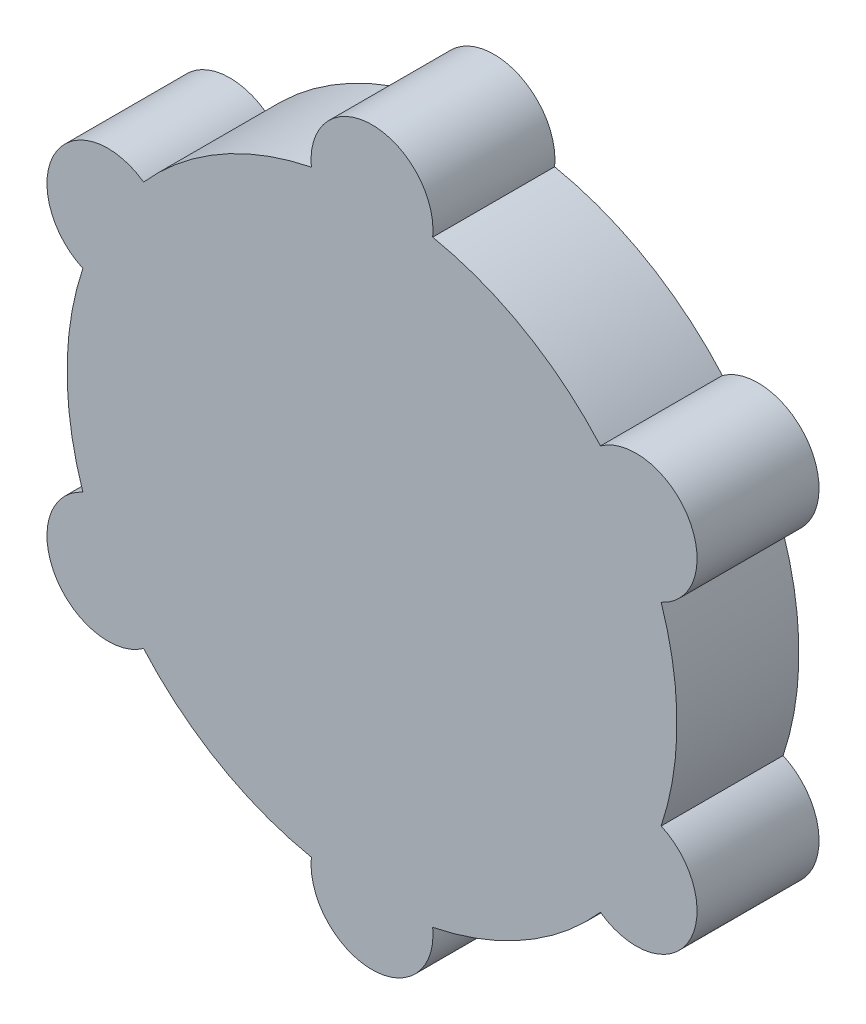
ISO-10303-21;
HEADER;
FILE_DESCRIPTION(('STEP AP214'),'2;1');
FILE_NAME('part.step','',(''),(''),'','','');
FILE_SCHEMA(('AUTOMOTIVE_DESIGN { 1 0 10303 214 1 1 1 1 }'));
ENDSEC;
DATA;
#1=APPLICATION_CONTEXT('core data for automotive mechanical design processes');
#2=APPLICATION_PROTOCOL_DEFINITION('international standard','automotive_design',2000,#1);
#3=PRODUCT_CONTEXT('',#1,'mechanical');
#4=PRODUCT('Part','Part','',(#3));
#5=PRODUCT_RELATED_PRODUCT_CATEGORY('part','',(#4));
#6=PRODUCT_DEFINITION_FORMATION('','',#4);
#7=PRODUCT_DEFINITION_CONTEXT('part definition',#1,'design');
#8=PRODUCT_DEFINITION('design','',#6,#7);
#9=PRODUCT_DEFINITION_SHAPE('','',#8);
#10=(LENGTH_UNIT() NAMED_UNIT(*) SI_UNIT(.MILLI.,.METRE.));
#11=(NAMED_UNIT(*) PLANE_ANGLE_UNIT() SI_UNIT($,.RADIAN.));
#12=(NAMED_UNIT(*) SI_UNIT($,.STERADIAN.) SOLID_ANGLE_UNIT());
#13=UNCERTAINTY_MEASURE_WITH_UNIT(LENGTH_MEASURE(1.E-05),#10,'distance_accuracy_value','');
#14=(GEOMETRIC_REPRESENTATION_CONTEXT(3) GLOBAL_UNCERTAINTY_ASSIGNED_CONTEXT((#13)) GLOBAL_UNIT_ASSIGNED_CONTEXT((#10,
#11,#12)) REPRESENTATION_CONTEXT('',''));
#15=CARTESIAN_POINT('',(0.,0.,0.));
#16=DIRECTION('',(0.,0.,1.));
#17=DIRECTION('',(1.,0.,0.));
#18=AXIS2_PLACEMENT_3D('',#15,#16,#17);
#19=CARTESIAN_POINT('',(43.301270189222,24.9999999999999,20.));
#20=DIRECTION('',(0.,0.,-1.));
#21=DIRECTION('',(-1.,0.,0.));
#22=AXIS2_PLACEMENT_3D('',#19,#20,#21);
#23=CYLINDRICAL_SURFACE('',#22,10.);
#24=CARTESIAN_POINT('',(43.301270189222,24.9999999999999,0.));
#25=DIRECTION('',(0.,0.,1.));
#26=DIRECTION('',(1.,0.,0.));
#27=AXIS2_PLACEMENT_3D('',#24,#25,#26);
#28=CIRCLE('',#27,10.);
#29=CARTESIAN_POINT('',(47.4101819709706,15.8831560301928,0.));
#30=VERTEX_POINT('',#29);
#31=CARTESIAN_POINT('',(37.4603075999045,33.1168439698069,0.));
#32=VERTEX_POINT('',#31);
#33=EDGE_CURVE('E124',#30,#32,#28,.T.);
#34=ORIENTED_EDGE('',*,*,#33,.T.);
#35=DIRECTION('',(0.,0.,-1.));
#36=VECTOR('',#35,1.);
#37=CARTESIAN_POINT('',(37.4603075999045,33.1168439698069,20.));
#38=LINE('',#37,#36);
#39=CARTESIAN_POINT('',(37.4603075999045,33.1168439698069,20.));
#40=VERTEX_POINT('',#39);
#41=EDGE_CURVE('E11',#40,#32,#38,.T.);
#42=ORIENTED_EDGE('',*,*,#41,.F.);
#43=CARTESIAN_POINT('',(43.301270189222,24.9999999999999,20.));
#44=DIRECTION('',(0.,0.,1.));
#45=DIRECTION('',(1.,0.,0.));
#46=AXIS2_PLACEMENT_3D('',#43,#44,#45);
#47=CIRCLE('',#46,10.);
#48=CARTESIAN_POINT('',(47.4101819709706,15.8831560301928,20.));
#49=VERTEX_POINT('',#48);
#50=EDGE_CURVE('E159',#49,#40,#47,.T.);
#51=ORIENTED_EDGE('',*,*,#50,.F.);
#52=DIRECTION('',(0.,0.,-1.));
#53=VECTOR('',#52,1.);
#54=CARTESIAN_POINT('',(47.4101819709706,15.8831560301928,20.));
#55=LINE('',#54,#53);
#56=EDGE_CURVE('E137',#49,#30,#55,.T.);
#57=ORIENTED_EDGE('',*,*,#56,.T.);
#58=EDGE_LOOP('',(#34,#42,#51,#57));
#59=FACE_BOUND('',#58,.T.);
#60=ADVANCED_FACE('F32',(#59),#23,.T.);
#61=CARTESIAN_POINT('',(0.,0.,20.));
#62=DIRECTION('',(0.,0.,-1.));
#63=DIRECTION('',(-1.,0.,0.));
#64=AXIS2_PLACEMENT_3D('',#61,#62,#63);
#65=CYLINDRICAL_SURFACE('',#64,50.);
#66=CARTESIAN_POINT('',(0.,0.,0.));
#67=DIRECTION('',(0.,0.,1.));
#68=DIRECTION('',(1.,0.,0.));
#69=AXIS2_PLACEMENT_3D('',#66,#67,#68);
#70=CIRCLE('',#69,50.);
#71=CARTESIAN_POINT('',(9.94987437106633,49.,0.));
#72=VERTEX_POINT('',#71);
#73=EDGE_CURVE('E120',#32,#72,#70,.T.);
#74=ORIENTED_EDGE('',*,*,#73,.T.);
#75=DIRECTION('',(0.,0.,-1.));
#76=VECTOR('',#75,1.);
#77=CARTESIAN_POINT('',(9.94987437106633,49.,20.));
#78=LINE('',#77,#76);
#79=CARTESIAN_POINT('',(9.94987437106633,49.,20.));
#80=VERTEX_POINT('',#79);
#81=EDGE_CURVE('E39',#80,#72,#78,.T.);
#82=ORIENTED_EDGE('',*,*,#81,.F.);
#83=CARTESIAN_POINT('',(0.,0.,20.));
#84=DIRECTION('',(0.,0.,1.));
#85=DIRECTION('',(1.,0.,0.));
#86=AXIS2_PLACEMENT_3D('',#83,#84,#85);
#87=CIRCLE('',#86,50.);
#88=EDGE_CURVE('E133',#40,#80,#87,.T.);
#89=ORIENTED_EDGE('',*,*,#88,.F.);
#90=ORIENTED_EDGE('',*,*,#41,.T.);
#91=EDGE_LOOP('',(#74,#82,#89,#90));
#92=FACE_BOUND('',#91,.T.);
#93=ADVANCED_FACE('F132',(#92),#65,.T.);
#94=CARTESIAN_POINT('',(1.11022302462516E-13,50.,20.));
#95=DIRECTION('',(0.,0.,-1.));
#96=DIRECTION('',(-1.,0.,0.));
#97=AXIS2_PLACEMENT_3D('',#94,#95,#96);
#98=CYLINDRICAL_SURFACE('',#97,10.);
#99=CARTESIAN_POINT('',(1.11022302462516E-13,50.,0.));
#100=DIRECTION('',(0.,0.,1.));
#101=DIRECTION('',(1.,0.,0.));
#102=AXIS2_PLACEMENT_3D('',#99,#100,#101);
#103=CIRCLE('',#102,10.);
#104=CARTESIAN_POINT('',(-9.9498743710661,49.,0.));
#105=VERTEX_POINT('',#104);
#106=EDGE_CURVE('E126',#72,#105,#103,.T.);
#107=ORIENTED_EDGE('',*,*,#106,.T.);
#108=DIRECTION('',(0.,0.,-1.));
#109=VECTOR('',#108,1.);
#110=CARTESIAN_POINT('',(-9.9498743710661,49.,20.));
#111=LINE('',#110,#109);
#112=CARTESIAN_POINT('',(-9.9498743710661,49.,20.));
#113=VERTEX_POINT('',#112);
#114=EDGE_CURVE('E205',#113,#105,#111,.T.);
#115=ORIENTED_EDGE('',*,*,#114,.F.);
#116=CARTESIAN_POINT('',(1.11022302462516E-13,50.,20.));
#117=DIRECTION('',(0.,0.,1.));
#118=DIRECTION('',(1.,0.,0.));
#119=AXIS2_PLACEMENT_3D('',#116,#117,#118);
#120=CIRCLE('',#119,10.);
#121=EDGE_CURVE('E162',#80,#113,#120,.T.);
#122=ORIENTED_EDGE('',*,*,#121,.F.);
#123=ORIENTED_EDGE('',*,*,#81,.T.);
#124=EDGE_LOOP('',(#107,#115,#122,#123));
#125=FACE_BOUND('',#124,.T.);
#126=ADVANCED_FACE('F209',(#125),#98,.T.);
#127=CARTESIAN_POINT('',(0.,0.,20.));
#128=DIRECTION('',(0.,0.,-1.));
#129=DIRECTION('',(-1.,0.,0.));
#130=AXIS2_PLACEMENT_3D('',#127,#128,#129);
#131=CYLINDRICAL_SURFACE('',#130,50.);
#132=CARTESIAN_POINT('',(0.,0.,0.));
#133=DIRECTION('',(0.,0.,1.));
#134=DIRECTION('',(1.,0.,0.));
#135=AXIS2_PLACEMENT_3D('',#132,#133,#134);
#136=CIRCLE('',#135,50.);
#137=CARTESIAN_POINT('',(-37.4603075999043,33.1168439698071,0.));
#138=VERTEX_POINT('',#137);
#139=EDGE_CURVE('E141',#105,#138,#136,.T.);
#140=ORIENTED_EDGE('',*,*,#139,.T.);
#141=DIRECTION('',(0.,0.,-1.));
#142=VECTOR('',#141,1.);
#143=CARTESIAN_POINT('',(-37.4603075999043,33.1168439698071,20.));
#144=LINE('',#143,#142);
#145=CARTESIAN_POINT('',(-37.4603075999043,33.1168439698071,20.));
#146=VERTEX_POINT('',#145);
#147=EDGE_CURVE('E202',#146,#138,#144,.T.);
#148=ORIENTED_EDGE('',*,*,#147,.F.);
#149=CARTESIAN_POINT('',(0.,0.,20.));
#150=DIRECTION('',(0.,0.,1.));
#151=DIRECTION('',(1.,0.,0.));
#152=AXIS2_PLACEMENT_3D('',#149,#150,#151);
#153=CIRCLE('',#152,50.);
#154=EDGE_CURVE('E164',#113,#146,#153,.T.);
#155=ORIENTED_EDGE('',*,*,#154,.F.);
#156=ORIENTED_EDGE('',*,*,#114,.T.);
#157=EDGE_LOOP('',(#140,#148,#155,#156));
#158=FACE_BOUND('',#157,.T.);
#159=ADVANCED_FACE('F217',(#158),#131,.T.);
#160=CARTESIAN_POINT('',(-43.3012701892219,25.0000000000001,20.));
#161=DIRECTION('',(0.,0.,-1.));
#162=DIRECTION('',(-1.,0.,0.));
#163=AXIS2_PLACEMENT_3D('',#160,#161,#162);
#164=CYLINDRICAL_SURFACE('',#163,10.);
#165=CARTESIAN_POINT('',(-43.3012701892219,25.0000000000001,0.));
#166=DIRECTION('',(0.,0.,1.));
#167=DIRECTION('',(1.,0.,0.));
#168=AXIS2_PLACEMENT_3D('',#165,#166,#167);
#169=CIRCLE('',#168,10.);
#170=CARTESIAN_POINT('',(-47.4101819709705,15.883156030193,0.));
#171=VERTEX_POINT('',#170);
#172=EDGE_CURVE('E143',#138,#171,#169,.T.);
#173=ORIENTED_EDGE('',*,*,#172,.T.);
#174=DIRECTION('',(0.,0.,-1.));
#175=VECTOR('',#174,1.);
#176=CARTESIAN_POINT('',(-47.4101819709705,15.883156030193,20.));
#177=LINE('',#176,#175);
#178=CARTESIAN_POINT('',(-47.4101819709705,15.883156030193,20.));
#179=VERTEX_POINT('',#178);
#180=EDGE_CURVE('E199',#179,#171,#177,.T.);
#181=ORIENTED_EDGE('',*,*,#180,.F.);
#182=CARTESIAN_POINT('',(-43.3012701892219,25.0000000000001,20.));
#183=DIRECTION('',(0.,0.,1.));
#184=DIRECTION('',(1.,0.,0.));
#185=AXIS2_PLACEMENT_3D('',#182,#183,#184);
#186=CIRCLE('',#185,10.);
#187=EDGE_CURVE('E166',#146,#179,#186,.T.);
#188=ORIENTED_EDGE('',*,*,#187,.F.);
#189=ORIENTED_EDGE('',*,*,#147,.T.);
#190=EDGE_LOOP('',(#173,#181,#188,#189));
#191=FACE_BOUND('',#190,.T.);
#192=ADVANCED_FACE('F220',(#191),#164,.T.);
#193=CARTESIAN_POINT('',(0.,0.,20.));
#194=DIRECTION('',(0.,0.,-1.));
#195=DIRECTION('',(-1.,0.,0.));
#196=AXIS2_PLACEMENT_3D('',#193,#194,#195);
#197=CYLINDRICAL_SURFACE('',#196,50.);
#198=CARTESIAN_POINT('',(0.,0.,0.));
#199=DIRECTION('',(0.,0.,1.));
#200=DIRECTION('',(1.,0.,0.));
#201=AXIS2_PLACEMENT_3D('',#198,#199,#200);
#202=CIRCLE('',#201,50.);
#203=CARTESIAN_POINT('',(-47.4101819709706,-15.8831560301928,0.));
#204=VERTEX_POINT('',#203);
#205=EDGE_CURVE('E145',#171,#204,#202,.T.);
#206=ORIENTED_EDGE('',*,*,#205,.T.);
#207=DIRECTION('',(0.,0.,-1.));
#208=VECTOR('',#207,1.);
#209=CARTESIAN_POINT('',(-47.4101819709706,-15.8831560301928,20.));
#210=LINE('',#209,#208);
#211=CARTESIAN_POINT('',(-47.4101819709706,-15.8831560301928,20.));
#212=VERTEX_POINT('',#211);
#213=EDGE_CURVE('E196',#212,#204,#210,.T.);
#214=ORIENTED_EDGE('',*,*,#213,.F.);
#215=CARTESIAN_POINT('',(0.,0.,20.));
#216=DIRECTION('',(0.,0.,1.));
#217=DIRECTION('',(1.,0.,0.));
#218=AXIS2_PLACEMENT_3D('',#215,#216,#217);
#219=CIRCLE('',#218,50.);
#220=EDGE_CURVE('E168',#179,#212,#219,.T.);
#221=ORIENTED_EDGE('',*,*,#220,.F.);
#222=ORIENTED_EDGE('',*,*,#180,.T.);
#223=EDGE_LOOP('',(#206,#214,#221,#222));
#224=FACE_BOUND('',#223,.T.);
#225=ADVANCED_FACE('F225',(#224),#197,.T.);
#226=CARTESIAN_POINT('',(-43.301270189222,-24.9999999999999,20.));
#227=DIRECTION('',(0.,0.,-1.));
#228=DIRECTION('',(-1.,0.,0.));
#229=AXIS2_PLACEMENT_3D('',#226,#227,#228);
#230=CYLINDRICAL_SURFACE('',#229,10.);
#231=CARTESIAN_POINT('',(-43.301270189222,-24.9999999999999,0.));
#232=DIRECTION('',(0.,0.,1.));
#233=DIRECTION('',(1.,0.,0.));
#234=AXIS2_PLACEMENT_3D('',#231,#232,#233);
#235=CIRCLE('',#234,10.);
#236=CARTESIAN_POINT('',(-37.4603075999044,-33.116843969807,0.));
#237=VERTEX_POINT('',#236);
#238=EDGE_CURVE('E147',#204,#237,#235,.T.);
#239=ORIENTED_EDGE('',*,*,#238,.T.);
#240=DIRECTION('',(0.,0.,-1.));
#241=VECTOR('',#240,1.);
#242=CARTESIAN_POINT('',(-37.4603075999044,-33.116843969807,20.));
#243=LINE('',#242,#241);
#244=CARTESIAN_POINT('',(-37.4603075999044,-33.116843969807,20.));
#245=VERTEX_POINT('',#244);
#246=EDGE_CURVE('E193',#245,#237,#243,.T.);
#247=ORIENTED_EDGE('',*,*,#246,.F.);
#248=CARTESIAN_POINT('',(-43.301270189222,-24.9999999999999,20.));
#249=DIRECTION('',(0.,0.,1.));
#250=DIRECTION('',(1.,0.,0.));
#251=AXIS2_PLACEMENT_3D('',#248,#249,#250);
#252=CIRCLE('',#251,10.);
#253=EDGE_CURVE('E170',#212,#245,#252,.T.);
#254=ORIENTED_EDGE('',*,*,#253,.F.);
#255=ORIENTED_EDGE('',*,*,#213,.T.);
#256=EDGE_LOOP('',(#239,#247,#254,#255));
#257=FACE_BOUND('',#256,.T.);
#258=ADVANCED_FACE('F231',(#257),#230,.T.);
#259=CARTESIAN_POINT('',(0.,0.,20.));
#260=DIRECTION('',(0.,0.,-1.));
#261=DIRECTION('',(-1.,0.,0.));
#262=AXIS2_PLACEMENT_3D('',#259,#260,#261);
#263=CYLINDRICAL_SURFACE('',#262,50.);
#264=CARTESIAN_POINT('',(0.,0.,0.));
#265=DIRECTION('',(0.,0.,1.));
#266=DIRECTION('',(1.,0.,0.));
#267=AXIS2_PLACEMENT_3D('',#264,#265,#266);
#268=CIRCLE('',#267,50.);
#269=CARTESIAN_POINT('',(-9.94987437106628,-48.9999999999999,0.));
#270=VERTEX_POINT('',#269);
#271=EDGE_CURVE('E149',#237,#270,#268,.T.);
#272=ORIENTED_EDGE('',*,*,#271,.T.);
#273=DIRECTION('',(0.,0.,-1.));
#274=VECTOR('',#273,1.);
#275=CARTESIAN_POINT('',(-9.94987437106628,-48.9999999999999,20.));
#276=LINE('',#275,#274);
#277=CARTESIAN_POINT('',(-9.94987437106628,-48.9999999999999,20.));
#278=VERTEX_POINT('',#277);
#279=EDGE_CURVE('E190',#278,#270,#276,.T.);
#280=ORIENTED_EDGE('',*,*,#279,.F.);
#281=CARTESIAN_POINT('',(0.,0.,20.));
#282=DIRECTION('',(0.,0.,1.));
#283=DIRECTION('',(1.,0.,0.));
#284=AXIS2_PLACEMENT_3D('',#281,#282,#283);
#285=CIRCLE('',#284,50.);
#286=EDGE_CURVE('E172',#245,#278,#285,.T.);
#287=ORIENTED_EDGE('',*,*,#286,.F.);
#288=ORIENTED_EDGE('',*,*,#246,.T.);
#289=EDGE_LOOP('',(#272,#280,#287,#288));
#290=FACE_BOUND('',#289,.T.);
#291=ADVANCED_FACE('F235',(#290),#263,.T.);
#292=CARTESIAN_POINT('',(-1.07552855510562E-13,-50.,20.));
#293=DIRECTION('',(0.,0.,-1.));
#294=DIRECTION('',(-1.,0.,0.));
#295=AXIS2_PLACEMENT_3D('',#292,#293,#294);
#296=CYLINDRICAL_SURFACE('',#295,10.);
#297=CARTESIAN_POINT('',(-1.07552855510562E-13,-50.,0.));
#298=DIRECTION('',(0.,0.,1.));
#299=DIRECTION('',(1.,0.,0.));
#300=AXIS2_PLACEMENT_3D('',#297,#298,#299);
#301=CIRCLE('',#300,10.);
#302=CARTESIAN_POINT('',(9.94987437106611,-49.,0.));
#303=VERTEX_POINT('',#302);
#304=EDGE_CURVE('E151',#270,#303,#301,.T.);
#305=ORIENTED_EDGE('',*,*,#304,.T.);
#306=DIRECTION('',(0.,0.,-1.));
#307=VECTOR('',#306,1.);
#308=CARTESIAN_POINT('',(9.94987437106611,-49.,20.));
#309=LINE('',#308,#307);
#310=CARTESIAN_POINT('',(9.94987437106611,-49.,20.));
#311=VERTEX_POINT('',#310);
#312=EDGE_CURVE('E187',#311,#303,#309,.T.);
#313=ORIENTED_EDGE('',*,*,#312,.F.);
#314=CARTESIAN_POINT('',(-1.07552855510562E-13,-50.,20.));
#315=DIRECTION('',(0.,0.,1.));
#316=DIRECTION('',(1.,0.,0.));
#317=AXIS2_PLACEMENT_3D('',#314,#315,#316);
#318=CIRCLE('',#317,10.);
#319=EDGE_CURVE('E174',#278,#311,#318,.T.);
#320=ORIENTED_EDGE('',*,*,#319,.F.);
#321=ORIENTED_EDGE('',*,*,#279,.T.);
#322=EDGE_LOOP('',(#305,#313,#320,#321));
#323=FACE_BOUND('',#322,.T.);
#324=ADVANCED_FACE('F240',(#323),#296,.T.);
#325=CARTESIAN_POINT('',(0.,0.,20.));
#326=DIRECTION('',(0.,0.,-1.));
#327=DIRECTION('',(-1.,0.,0.));
#328=AXIS2_PLACEMENT_3D('',#325,#326,#327);
#329=CYLINDRICAL_SURFACE('',#328,50.);
#330=CARTESIAN_POINT('',(0.,0.,0.));
#331=DIRECTION('',(0.,0.,1.));
#332=DIRECTION('',(1.,0.,0.));
#333=AXIS2_PLACEMENT_3D('',#330,#331,#332);
#334=CIRCLE('',#333,50.);
#335=CARTESIAN_POINT('',(37.4603075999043,-33.1168439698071,0.));
#336=VERTEX_POINT('',#335);
#337=EDGE_CURVE('E153',#303,#336,#334,.T.);
#338=ORIENTED_EDGE('',*,*,#337,.T.);
#339=DIRECTION('',(0.,0.,-1.));
#340=VECTOR('',#339,1.);
#341=CARTESIAN_POINT('',(37.4603075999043,-33.1168439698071,20.));
#342=LINE('',#341,#340);
#343=CARTESIAN_POINT('',(37.4603075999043,-33.1168439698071,20.));
#344=VERTEX_POINT('',#343);
#345=EDGE_CURVE('E184',#344,#336,#342,.T.);
#346=ORIENTED_EDGE('',*,*,#345,.F.);
#347=CARTESIAN_POINT('',(0.,0.,20.));
#348=DIRECTION('',(0.,0.,1.));
#349=DIRECTION('',(1.,0.,0.));
#350=AXIS2_PLACEMENT_3D('',#347,#348,#349);
#351=CIRCLE('',#350,50.);
#352=EDGE_CURVE('E176',#311,#344,#351,.T.);
#353=ORIENTED_EDGE('',*,*,#352,.F.);
#354=ORIENTED_EDGE('',*,*,#312,.T.);
#355=EDGE_LOOP('',(#338,#346,#353,#354));
#356=FACE_BOUND('',#355,.T.);
#357=ADVANCED_FACE('F244',(#356),#329,.T.);
#358=CARTESIAN_POINT('',(43.3012701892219,-25.0000000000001,20.));
#359=DIRECTION('',(0.,0.,-1.));
#360=DIRECTION('',(-1.,0.,0.));
#361=AXIS2_PLACEMENT_3D('',#358,#359,#360);
#362=CYLINDRICAL_SURFACE('',#361,10.);
#363=CARTESIAN_POINT('',(43.3012701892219,-25.0000000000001,0.));
#364=DIRECTION('',(0.,0.,1.));
#365=DIRECTION('',(1.,0.,0.));
#366=AXIS2_PLACEMENT_3D('',#363,#364,#365);
#367=CIRCLE('',#366,10.);
#368=CARTESIAN_POINT('',(47.4101819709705,-15.883156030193,0.));
#369=VERTEX_POINT('',#368);
#370=EDGE_CURVE('E155',#336,#369,#367,.T.);
#371=ORIENTED_EDGE('',*,*,#370,.T.);
#372=DIRECTION('',(0.,0.,-1.));
#373=VECTOR('',#372,1.);
#374=CARTESIAN_POINT('',(47.4101819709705,-15.883156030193,20.));
#375=LINE('',#374,#373);
#376=CARTESIAN_POINT('',(47.4101819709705,-15.883156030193,20.));
#377=VERTEX_POINT('',#376);
#378=EDGE_CURVE('E181',#377,#369,#375,.T.);
#379=ORIENTED_EDGE('',*,*,#378,.F.);
#380=CARTESIAN_POINT('',(43.3012701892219,-25.0000000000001,20.));
#381=DIRECTION('',(0.,0.,1.));
#382=DIRECTION('',(1.,0.,0.));
#383=AXIS2_PLACEMENT_3D('',#380,#381,#382);
#384=CIRCLE('',#383,10.);
#385=EDGE_CURVE('E51',#344,#377,#384,.T.);
#386=ORIENTED_EDGE('',*,*,#385,.F.);
#387=ORIENTED_EDGE('',*,*,#345,.T.);
#388=EDGE_LOOP('',(#371,#379,#386,#387));
#389=FACE_BOUND('',#388,.T.);
#390=ADVANCED_FACE('F248',(#389),#362,.T.);
#391=CARTESIAN_POINT('',(0.,0.,20.));
#392=DIRECTION('',(0.,0.,-1.));
#393=DIRECTION('',(-1.,0.,0.));
#394=AXIS2_PLACEMENT_3D('',#391,#392,#393);
#395=CYLINDRICAL_SURFACE('',#394,50.);
#396=CARTESIAN_POINT('',(0.,0.,0.));
#397=DIRECTION('',(0.,0.,1.));
#398=DIRECTION('',(1.,0.,0.));
#399=AXIS2_PLACEMENT_3D('',#396,#397,#398);
#400=CIRCLE('',#399,50.);
#401=EDGE_CURVE('E157',#369,#30,#400,.T.);
#402=ORIENTED_EDGE('',*,*,#401,.T.);
#403=ORIENTED_EDGE('',*,*,#56,.F.);
#404=CARTESIAN_POINT('',(0.,0.,20.));
#405=DIRECTION('',(0.,0.,1.));
#406=DIRECTION('',(1.,0.,0.));
#407=AXIS2_PLACEMENT_3D('',#404,#405,#406);
#408=CIRCLE('',#407,50.);
#409=EDGE_CURVE('E46',#377,#49,#408,.T.);
#410=ORIENTED_EDGE('',*,*,#409,.F.);
#411=ORIENTED_EDGE('',*,*,#378,.T.);
#412=EDGE_LOOP('',(#402,#403,#410,#411));
#413=FACE_BOUND('',#412,.T.);
#414=ADVANCED_FACE('F250',(#413),#395,.T.);
#415=CARTESIAN_POINT('',(21.650635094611,12.4999999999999,20.));
#416=DIRECTION('',(0.,0.,1.));
#417=DIRECTION('',(1.,0.,0.));
#418=AXIS2_PLACEMENT_3D('',#415,#416,#417);
#419=PLANE('',#418);
#420=ORIENTED_EDGE('',*,*,#50,.T.);
#421=ORIENTED_EDGE('',*,*,#88,.T.);
#422=ORIENTED_EDGE('',*,*,#121,.T.);
#423=ORIENTED_EDGE('',*,*,#154,.T.);
#424=ORIENTED_EDGE('',*,*,#187,.T.);
#425=ORIENTED_EDGE('',*,*,#220,.T.);
#426=ORIENTED_EDGE('',*,*,#253,.T.);
#427=ORIENTED_EDGE('',*,*,#286,.T.);
#428=ORIENTED_EDGE('',*,*,#319,.T.);
#429=ORIENTED_EDGE('',*,*,#352,.T.);
#430=ORIENTED_EDGE('',*,*,#385,.T.);
#431=ORIENTED_EDGE('',*,*,#409,.T.);
#432=EDGE_LOOP('',(#420,#421,#422,#423,#424,#425,#426,#427,#428,#429,#430,#431));
#433=FACE_BOUND('',#432,.T.);
#434=ADVANCED_FACE('F212',(#433),#419,.T.);
#435=CARTESIAN_POINT('',(21.650635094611,12.4999999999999,0.));
#436=DIRECTION('',(0.,0.,1.));
#437=DIRECTION('',(1.,0.,0.));
#438=AXIS2_PLACEMENT_3D('',#435,#436,#437);
#439=PLANE('',#438);
#440=ORIENTED_EDGE('',*,*,#33,.F.);
#441=ORIENTED_EDGE('',*,*,#401,.F.);
#442=ORIENTED_EDGE('',*,*,#370,.F.);
#443=ORIENTED_EDGE('',*,*,#337,.F.);
#444=ORIENTED_EDGE('',*,*,#304,.F.);
#445=ORIENTED_EDGE('',*,*,#271,.F.);
#446=ORIENTED_EDGE('',*,*,#238,.F.);
#447=ORIENTED_EDGE('',*,*,#205,.F.);
#448=ORIENTED_EDGE('',*,*,#172,.F.);
#449=ORIENTED_EDGE('',*,*,#139,.F.);
#450=ORIENTED_EDGE('',*,*,#106,.F.);
#451=ORIENTED_EDGE('',*,*,#73,.F.);
#452=EDGE_LOOP('',(#440,#441,#442,#443,#444,#445,#446,#447,#448,#449,#450,#451));
#453=FACE_BOUND('',#452,.T.);
#454=ADVANCED_FACE('F121',(#453),#439,.F.);
#455=CLOSED_SHELL('',(#60,#93,#126,#159,#192,#225,#258,#291,#324,#357,#390,#414,#434,#454));
#456=MANIFOLD_SOLID_BREP('B2',#455);
#457=ADVANCED_BREP_SHAPE_REPRESENTATION('',(#18,#456),#14);
#458=SHAPE_DEFINITION_REPRESENTATION(#9,#457);
ENDSEC;
END-ISO-10303-21;
